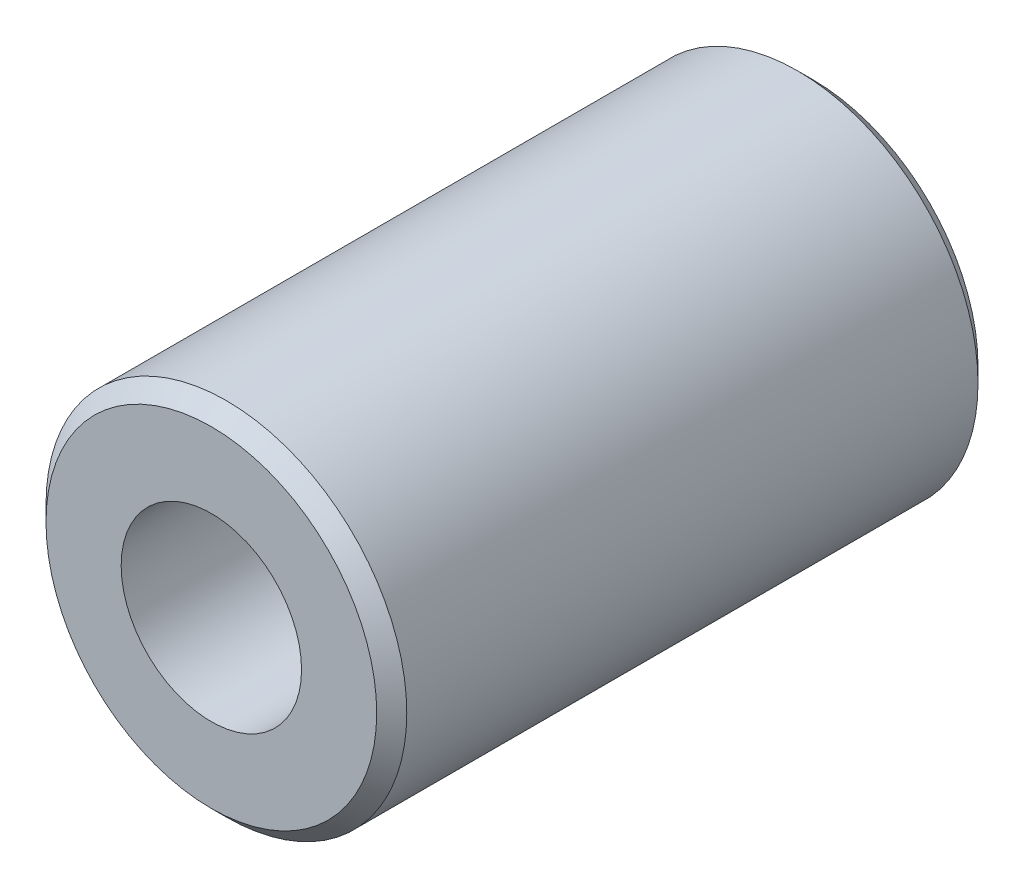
ISO-10303-21;
HEADER;
FILE_DESCRIPTION(('STEP AP214'),'2;1');
FILE_NAME('part.step','',(''),(''),'','','');
FILE_SCHEMA(('AUTOMOTIVE_DESIGN { 1 0 10303 214 1 1 1 1 }'));
ENDSEC;
DATA;
#1=APPLICATION_CONTEXT('core data for automotive mechanical design processes');
#2=APPLICATION_PROTOCOL_DEFINITION('international standard','automotive_design',2000,#1);
#3=PRODUCT_CONTEXT('',#1,'mechanical');
#4=PRODUCT('Part','Part','',(#3));
#5=PRODUCT_RELATED_PRODUCT_CATEGORY('part','',(#4));
#6=PRODUCT_DEFINITION_FORMATION('','',#4);
#7=PRODUCT_DEFINITION_CONTEXT('part definition',#1,'design');
#8=PRODUCT_DEFINITION('design','',#6,#7);
#9=PRODUCT_DEFINITION_SHAPE('','',#8);
#10=(LENGTH_UNIT() NAMED_UNIT(*) SI_UNIT(.MILLI.,.METRE.));
#11=(NAMED_UNIT(*) PLANE_ANGLE_UNIT() SI_UNIT($,.RADIAN.));
#12=(NAMED_UNIT(*) SI_UNIT($,.STERADIAN.) SOLID_ANGLE_UNIT());
#13=UNCERTAINTY_MEASURE_WITH_UNIT(LENGTH_MEASURE(1.E-05),#10,'distance_accuracy_value','');
#14=(GEOMETRIC_REPRESENTATION_CONTEXT(3) GLOBAL_UNCERTAINTY_ASSIGNED_CONTEXT((#13)) GLOBAL_UNIT_ASSIGNED_CONTEXT((#10,
#11,#12)) REPRESENTATION_CONTEXT('',''));
#15=CARTESIAN_POINT('',(0.,0.,0.));
#16=DIRECTION('',(0.,0.,1.));
#17=DIRECTION('',(1.,0.,0.));
#18=AXIS2_PLACEMENT_3D('',#15,#16,#17);
#19=CARTESIAN_POINT('',(0.,0.,10.));
#20=DIRECTION('',(0.,0.,1.));
#21=DIRECTION('',(1.,0.,0.));
#22=AXIS2_PLACEMENT_3D('',#19,#20,#21);
#23=PLANE('',#22);
#24=CARTESIAN_POINT('',(0.,0.,10.));
#25=DIRECTION('',(0.,0.,1.));
#26=DIRECTION('',(1.,0.,0.));
#27=AXIS2_PLACEMENT_3D('',#24,#25,#26);
#28=CIRCLE('',#27,5.5);
#29=CARTESIAN_POINT('',(5.5,0.,10.));
#30=VERTEX_POINT('',#29);
#31=EDGE_CURVE('E10',#30,#30,#28,.T.);
#32=ORIENTED_EDGE('',*,*,#31,.T.);
#33=EDGE_LOOP('',(#32));
#34=FACE_BOUND('',#33,.T.);
#35=CARTESIAN_POINT('',(0.,0.,10.));
#36=DIRECTION('',(0.,0.,1.));
#37=DIRECTION('',(1.,0.,0.));
#38=AXIS2_PLACEMENT_3D('',#35,#36,#37);
#39=CIRCLE('',#38,3.);
#40=CARTESIAN_POINT('',(3.,0.,10.));
#41=VERTEX_POINT('',#40);
#42=EDGE_CURVE('E50',#41,#41,#39,.T.);
#43=ORIENTED_EDGE('',*,*,#42,.F.);
#44=EDGE_LOOP('',(#43));
#45=FACE_BOUND('',#44,.T.);
#46=ADVANCED_FACE('F30',(#34,#45),#23,.T.);
#47=CARTESIAN_POINT('',(0.,0.,-10.));
#48=DIRECTION('',(0.,0.,1.));
#49=DIRECTION('',(1.,0.,0.));
#50=AXIS2_PLACEMENT_3D('',#47,#48,#49);
#51=PLANE('',#50);
#52=CARTESIAN_POINT('',(0.,0.,-10.));
#53=DIRECTION('',(0.,0.,1.));
#54=DIRECTION('',(1.,0.,0.));
#55=AXIS2_PLACEMENT_3D('',#52,#53,#54);
#56=CIRCLE('',#55,5.5);
#57=CARTESIAN_POINT('',(5.5,0.,-10.));
#58=VERTEX_POINT('',#57);
#59=EDGE_CURVE('E37',#58,#58,#56,.F.);
#60=ORIENTED_EDGE('',*,*,#59,.T.);
#61=EDGE_LOOP('',(#60));
#62=FACE_BOUND('',#61,.T.);
#63=CARTESIAN_POINT('',(0.,0.,-10.));
#64=DIRECTION('',(0.,0.,1.));
#65=DIRECTION('',(1.,0.,0.));
#66=AXIS2_PLACEMENT_3D('',#63,#64,#65);
#67=CIRCLE('',#66,3.);
#68=CARTESIAN_POINT('',(3.,0.,-10.));
#69=VERTEX_POINT('',#68);
#70=EDGE_CURVE('E51',#69,#69,#67,.T.);
#71=ORIENTED_EDGE('',*,*,#70,.T.);
#72=EDGE_LOOP('',(#71));
#73=FACE_BOUND('',#72,.T.);
#74=ADVANCED_FACE('F61',(#62,#73),#51,.F.);
#75=CARTESIAN_POINT('',(0.,0.,10.));
#76=DIRECTION('',(0.,0.,-1.));
#77=DIRECTION('',(-1.,0.,0.));
#78=AXIS2_PLACEMENT_3D('',#75,#76,#77);
#79=CYLINDRICAL_SURFACE('',#78,6.);
#80=CARTESIAN_POINT('',(0.,0.,-9.5));
#81=DIRECTION('',(0.,0.,1.));
#82=DIRECTION('',(1.,0.,0.));
#83=AXIS2_PLACEMENT_3D('',#80,#81,#82);
#84=CIRCLE('',#83,6.);
#85=CARTESIAN_POINT('',(6.,0.,-9.5));
#86=VERTEX_POINT('',#85);
#87=EDGE_CURVE('E41',#86,#86,#84,.T.);
#88=ORIENTED_EDGE('',*,*,#87,.T.);
#89=EDGE_LOOP('',(#88));
#90=FACE_BOUND('',#89,.T.);
#91=CARTESIAN_POINT('',(0.,0.,9.5));
#92=DIRECTION('',(0.,0.,1.));
#93=DIRECTION('',(1.,0.,0.));
#94=AXIS2_PLACEMENT_3D('',#91,#92,#93);
#95=CIRCLE('',#94,6.);
#96=CARTESIAN_POINT('',(6.,0.,9.5));
#97=VERTEX_POINT('',#96);
#98=EDGE_CURVE('E45',#97,#97,#95,.F.);
#99=ORIENTED_EDGE('',*,*,#98,.T.);
#100=EDGE_LOOP('',(#99));
#101=FACE_BOUND('',#100,.T.);
#102=ADVANCED_FACE('F66',(#90,#101),#79,.T.);
#103=CARTESIAN_POINT('',(0.,0.,10.));
#104=DIRECTION('',(0.,0.,-1.));
#105=DIRECTION('',(-1.,0.,0.));
#106=AXIS2_PLACEMENT_3D('',#103,#104,#105);
#107=CYLINDRICAL_SURFACE('',#106,3.);
#108=ORIENTED_EDGE('',*,*,#42,.T.);
#109=EDGE_LOOP('',(#108));
#110=FACE_BOUND('',#109,.T.);
#111=ORIENTED_EDGE('',*,*,#70,.F.);
#112=EDGE_LOOP('',(#111));
#113=FACE_BOUND('',#112,.T.);
#114=ADVANCED_FACE('F57',(#110,#113),#107,.F.);
#115=CARTESIAN_POINT('',(0.,0.,-9.5));
#116=DIRECTION('',(0.,0.,1.));
#117=DIRECTION('',(1.,0.,0.));
#118=AXIS2_PLACEMENT_3D('',#115,#116,#117);
#119=CONICAL_SURFACE('',#118,6.,0.78539816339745);
#120=ORIENTED_EDGE('',*,*,#59,.F.);
#121=EDGE_LOOP('',(#120));
#122=FACE_BOUND('',#121,.T.);
#123=ORIENTED_EDGE('',*,*,#87,.F.);
#124=EDGE_LOOP('',(#123));
#125=FACE_BOUND('',#124,.T.);
#126=ADVANCED_FACE('F72',(#122,#125),#119,.T.);
#127=CARTESIAN_POINT('',(0.,0.,10.));
#128=DIRECTION('',(0.,0.,-1.));
#129=DIRECTION('',(-1.,0.,0.));
#130=AXIS2_PLACEMENT_3D('',#127,#128,#129);
#131=CONICAL_SURFACE('',#130,5.5,0.785398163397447);
#132=ORIENTED_EDGE('',*,*,#98,.F.);
#133=EDGE_LOOP('',(#132));
#134=FACE_BOUND('',#133,.T.);
#135=ORIENTED_EDGE('',*,*,#31,.F.);
#136=EDGE_LOOP('',(#135));
#137=FACE_BOUND('',#136,.T.);
#138=ADVANCED_FACE('F32',(#134,#137),#131,.T.);
#139=CLOSED_SHELL('',(#46,#74,#102,#114,#126,#138));
#140=MANIFOLD_SOLID_BREP('B2',#139);
#141=ADVANCED_BREP_SHAPE_REPRESENTATION('',(#18,#140),#14);
#142=SHAPE_DEFINITION_REPRESENTATION(#9,#141);
ENDSEC;
END-ISO-10303-21;
